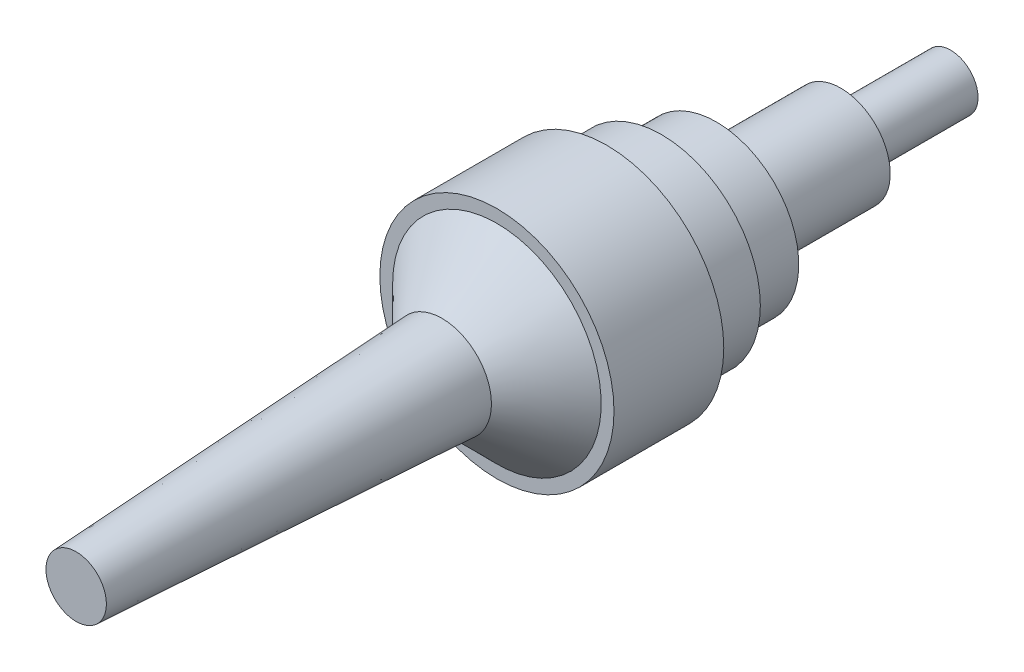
ISO-10303-21;
HEADER;
FILE_DESCRIPTION(('STEP AP214'),'2;1');
FILE_NAME('part.step','',(''),(''),'','','');
FILE_SCHEMA(('AUTOMOTIVE_DESIGN { 1 0 10303 214 1 1 1 1 }'));
ENDSEC;
DATA;
#1=APPLICATION_CONTEXT('core data for automotive mechanical design processes');
#2=APPLICATION_PROTOCOL_DEFINITION('international standard','automotive_design',2000,#1);
#3=PRODUCT_CONTEXT('',#1,'mechanical');
#4=PRODUCT('Part','Part','',(#3));
#5=PRODUCT_RELATED_PRODUCT_CATEGORY('part','',(#4));
#6=PRODUCT_DEFINITION_FORMATION('','',#4);
#7=PRODUCT_DEFINITION_CONTEXT('part definition',#1,'design');
#8=PRODUCT_DEFINITION('design','',#6,#7);
#9=PRODUCT_DEFINITION_SHAPE('','',#8);
#10=(LENGTH_UNIT() NAMED_UNIT(*) SI_UNIT(.MILLI.,.METRE.));
#11=(NAMED_UNIT(*) PLANE_ANGLE_UNIT() SI_UNIT($,.RADIAN.));
#12=(NAMED_UNIT(*) SI_UNIT($,.STERADIAN.) SOLID_ANGLE_UNIT());
#13=UNCERTAINTY_MEASURE_WITH_UNIT(LENGTH_MEASURE(1.E-05),#10,'distance_accuracy_value','');
#14=(GEOMETRIC_REPRESENTATION_CONTEXT(3) GLOBAL_UNCERTAINTY_ASSIGNED_CONTEXT((#13)) GLOBAL_UNIT_ASSIGNED_CONTEXT((#10,
#11,#12)) REPRESENTATION_CONTEXT('',''));
#15=CARTESIAN_POINT('',(0.,0.,0.));
#16=DIRECTION('',(0.,0.,1.));
#17=DIRECTION('',(1.,0.,0.));
#18=AXIS2_PLACEMENT_3D('',#15,#16,#17);
#19=CARTESIAN_POINT('',(0.,0.,0.));
#20=DIRECTION('',(0.,0.,-1.));
#21=DIRECTION('',(1.,0.,0.));
#22=AXIS2_PLACEMENT_3D('',#19,#20,#21);
#23=CONICAL_SURFACE('',#22,1.35,0.05235987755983);
#24=CARTESIAN_POINT('',(0.,0.,10.));
#25=DIRECTION('',(0.,0.,1.));
#26=DIRECTION('',(1.,0.,0.));
#27=AXIS2_PLACEMENT_3D('',#24,#25,#26);
#28=CIRCLE('',#27,0.825922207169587);
#29=CARTESIAN_POINT('',(0.825922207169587,0.,10.));
#30=VERTEX_POINT('',#29);
#31=EDGE_CURVE('E46',#30,#30,#28,.T.);
#32=ORIENTED_EDGE('',*,*,#31,.F.);
#33=EDGE_LOOP('',(#32));
#34=FACE_BOUND('',#33,.T.);
#35=CARTESIAN_POINT('',(0.,0.,0.));
#36=DIRECTION('',(0.,0.,-1.));
#37=DIRECTION('',(-1.,0.,0.));
#38=AXIS2_PLACEMENT_3D('',#35,#36,#37);
#39=CIRCLE('',#38,1.35);
#40=CARTESIAN_POINT('',(-1.35,0.,0.));
#41=VERTEX_POINT('',#40);
#42=EDGE_CURVE('E86',#41,#41,#39,.T.);
#43=ORIENTED_EDGE('',*,*,#42,.F.);
#44=EDGE_LOOP('',(#43));
#45=FACE_BOUND('',#44,.T.);
#46=ADVANCED_FACE('F43',(#34,#45),#23,.T.);
#47=CARTESIAN_POINT('',(0.,0.,10.));
#48=DIRECTION('',(0.,0.,1.));
#49=DIRECTION('',(1.,0.,0.));
#50=AXIS2_PLACEMENT_3D('',#47,#48,#49);
#51=PLANE('',#50);
#52=ORIENTED_EDGE('',*,*,#31,.T.);
#53=EDGE_LOOP('',(#52));
#54=FACE_BOUND('',#53,.T.);
#55=ADVANCED_FACE('F101',(#54),#51,.T.);
#56=CARTESIAN_POINT('',(0.,0.,0.));
#57=DIRECTION('',(0.,0.,-1.));
#58=DIRECTION('',(-1.,0.,0.));
#59=AXIS2_PLACEMENT_3D('',#56,#57,#58);
#60=CONICAL_SURFACE('',#59,1.35,0.78539816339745);
#61=CARTESIAN_POINT('',(0.,0.,-1.5));
#62=DIRECTION('',(0.,0.,-1.));
#63=DIRECTION('',(-1.,0.,0.));
#64=AXIS2_PLACEMENT_3D('',#61,#62,#63);
#65=CIRCLE('',#64,2.85000000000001);
#66=CARTESIAN_POINT('',(-2.85000000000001,0.,-1.5));
#67=VERTEX_POINT('',#66);
#68=EDGE_CURVE('E92',#67,#67,#65,.T.);
#69=ORIENTED_EDGE('',*,*,#68,.F.);
#70=EDGE_LOOP('',(#69));
#71=FACE_BOUND('',#70,.T.);
#72=ORIENTED_EDGE('',*,*,#42,.T.);
#73=EDGE_LOOP('',(#72));
#74=FACE_BOUND('',#73,.T.);
#75=ADVANCED_FACE('F107',(#71,#74),#60,.T.);
#76=CARTESIAN_POINT('',(0.,0.,-4.5));
#77=DIRECTION('',(0.,0.,1.));
#78=DIRECTION('',(1.,0.,0.));
#79=AXIS2_PLACEMENT_3D('',#76,#77,#78);
#80=CYLINDRICAL_SURFACE('',#79,3.2);
#81=CARTESIAN_POINT('',(0.,0.,-4.5));
#82=DIRECTION('',(0.,0.,-1.));
#83=DIRECTION('',(-1.,0.,0.));
#84=AXIS2_PLACEMENT_3D('',#81,#82,#83);
#85=CIRCLE('',#84,3.2);
#86=CARTESIAN_POINT('',(-3.2,0.,-4.5));
#87=VERTEX_POINT('',#86);
#88=EDGE_CURVE('E82',#87,#87,#85,.T.);
#89=ORIENTED_EDGE('',*,*,#88,.F.);
#90=EDGE_LOOP('',(#89));
#91=FACE_BOUND('',#90,.T.);
#92=CARTESIAN_POINT('',(0.,0.,-1.5));
#93=DIRECTION('',(0.,0.,-1.));
#94=DIRECTION('',(-1.,0.,0.));
#95=AXIS2_PLACEMENT_3D('',#92,#93,#94);
#96=CIRCLE('',#95,3.2);
#97=CARTESIAN_POINT('',(-3.2,0.,-1.5));
#98=VERTEX_POINT('',#97);
#99=EDGE_CURVE('E78',#98,#98,#96,.T.);
#100=ORIENTED_EDGE('',*,*,#99,.T.);
#101=EDGE_LOOP('',(#100));
#102=FACE_BOUND('',#101,.T.);
#103=ADVANCED_FACE('F109',(#91,#102),#80,.T.);
#104=CARTESIAN_POINT('',(0.,0.,-4.5));
#105=DIRECTION('',(0.,0.,-1.));
#106=DIRECTION('',(-1.,0.,0.));
#107=AXIS2_PLACEMENT_3D('',#104,#105,#106);
#108=PLANE('',#107);
#109=CARTESIAN_POINT('',(0.,0.,-4.5));
#110=DIRECTION('',(0.,0.,-1.));
#111=DIRECTION('',(-1.,0.,0.));
#112=AXIS2_PLACEMENT_3D('',#109,#110,#111);
#113=CIRCLE('',#112,2.7);
#114=CARTESIAN_POINT('',(-2.7,0.,-4.5));
#115=VERTEX_POINT('',#114);
#116=EDGE_CURVE('E74',#115,#115,#113,.T.);
#117=ORIENTED_EDGE('',*,*,#116,.F.);
#118=EDGE_LOOP('',(#117));
#119=FACE_BOUND('',#118,.T.);
#120=ORIENTED_EDGE('',*,*,#88,.T.);
#121=EDGE_LOOP('',(#120));
#122=FACE_BOUND('',#121,.T.);
#123=ADVANCED_FACE('F116',(#119,#122),#108,.T.);
#124=CARTESIAN_POINT('',(0.,0.,-1.5));
#125=DIRECTION('',(0.,0.,-1.));
#126=DIRECTION('',(-1.,0.,0.));
#127=AXIS2_PLACEMENT_3D('',#124,#125,#126);
#128=PLANE('',#127);
#129=ORIENTED_EDGE('',*,*,#68,.T.);
#130=EDGE_LOOP('',(#129));
#131=FACE_BOUND('',#130,.T.);
#132=ORIENTED_EDGE('',*,*,#99,.F.);
#133=EDGE_LOOP('',(#132));
#134=FACE_BOUND('',#133,.T.);
#135=ADVANCED_FACE('F120',(#131,#134),#128,.F.);
#136=CARTESIAN_POINT('',(0.,0.,-6.));
#137=DIRECTION('',(0.,0.,1.));
#138=DIRECTION('',(1.,0.,0.));
#139=AXIS2_PLACEMENT_3D('',#136,#137,#138);
#140=CYLINDRICAL_SURFACE('',#139,2.7);
#141=CARTESIAN_POINT('',(0.,0.,-6.));
#142=DIRECTION('',(0.,0.,-1.));
#143=DIRECTION('',(-1.,0.,0.));
#144=AXIS2_PLACEMENT_3D('',#141,#142,#143);
#145=CIRCLE('',#144,2.7);
#146=CARTESIAN_POINT('',(-2.7,0.,-6.));
#147=VERTEX_POINT('',#146);
#148=EDGE_CURVE('E70',#147,#147,#145,.T.);
#149=ORIENTED_EDGE('',*,*,#148,.F.);
#150=EDGE_LOOP('',(#149));
#151=FACE_BOUND('',#150,.T.);
#152=ORIENTED_EDGE('',*,*,#116,.T.);
#153=EDGE_LOOP('',(#152));
#154=FACE_BOUND('',#153,.T.);
#155=ADVANCED_FACE('F123',(#151,#154),#140,.T.);
#156=CARTESIAN_POINT('',(0.,0.,-6.));
#157=DIRECTION('',(0.,0.,-1.));
#158=DIRECTION('',(-1.,0.,0.));
#159=AXIS2_PLACEMENT_3D('',#156,#157,#158);
#160=PLANE('',#159);
#161=CARTESIAN_POINT('',(0.,0.,-6.));
#162=DIRECTION('',(0.,0.,-1.));
#163=DIRECTION('',(-1.,0.,0.));
#164=AXIS2_PLACEMENT_3D('',#161,#162,#163);
#165=CIRCLE('',#164,2.25);
#166=CARTESIAN_POINT('',(-2.25,0.,-6.));
#167=VERTEX_POINT('',#166);
#168=EDGE_CURVE('E57',#167,#167,#165,.T.);
#169=ORIENTED_EDGE('',*,*,#168,.F.);
#170=EDGE_LOOP('',(#169));
#171=FACE_BOUND('',#170,.T.);
#172=ORIENTED_EDGE('',*,*,#148,.T.);
#173=EDGE_LOOP('',(#172));
#174=FACE_BOUND('',#173,.T.);
#175=ADVANCED_FACE('F129',(#171,#174),#160,.T.);
#176=CARTESIAN_POINT('',(0.,0.,-7.5));
#177=DIRECTION('',(0.,0.,1.));
#178=DIRECTION('',(1.,0.,0.));
#179=AXIS2_PLACEMENT_3D('',#176,#177,#178);
#180=CYLINDRICAL_SURFACE('',#179,2.25);
#181=CARTESIAN_POINT('',(0.,0.,-7.5));
#182=DIRECTION('',(0.,0.,-1.));
#183=DIRECTION('',(-1.,0.,0.));
#184=AXIS2_PLACEMENT_3D('',#181,#182,#183);
#185=CIRCLE('',#184,2.25);
#186=CARTESIAN_POINT('',(-2.25,0.,-7.5));
#187=VERTEX_POINT('',#186);
#188=EDGE_CURVE('E65',#187,#187,#185,.T.);
#189=ORIENTED_EDGE('',*,*,#188,.F.);
#190=EDGE_LOOP('',(#189));
#191=FACE_BOUND('',#190,.T.);
#192=ORIENTED_EDGE('',*,*,#168,.T.);
#193=EDGE_LOOP('',(#192));
#194=FACE_BOUND('',#193,.T.);
#195=ADVANCED_FACE('F133',(#191,#194),#180,.T.);
#196=CARTESIAN_POINT('',(0.,0.,-7.5));
#197=DIRECTION('',(0.,0.,-1.));
#198=DIRECTION('',(-1.,0.,0.));
#199=AXIS2_PLACEMENT_3D('',#196,#197,#198);
#200=PLANE('',#199);
#201=CARTESIAN_POINT('',(0.,0.,-7.5));
#202=DIRECTION('',(0.,0.,-1.));
#203=DIRECTION('',(-1.,0.,0.));
#204=AXIS2_PLACEMENT_3D('',#201,#202,#203);
#205=CIRCLE('',#204,1.35);
#206=CARTESIAN_POINT('',(-1.35,0.,-7.5));
#207=VERTEX_POINT('',#206);
#208=EDGE_CURVE('E51',#207,#207,#205,.T.);
#209=ORIENTED_EDGE('',*,*,#208,.F.);
#210=EDGE_LOOP('',(#209));
#211=FACE_BOUND('',#210,.T.);
#212=ORIENTED_EDGE('',*,*,#188,.T.);
#213=EDGE_LOOP('',(#212));
#214=FACE_BOUND('',#213,.T.);
#215=ADVANCED_FACE('F137',(#211,#214),#200,.T.);
#216=CARTESIAN_POINT('',(0.,0.,-10.9));
#217=DIRECTION('',(0.,0.,1.));
#218=DIRECTION('',(1.,0.,0.));
#219=AXIS2_PLACEMENT_3D('',#216,#217,#218);
#220=CYLINDRICAL_SURFACE('',#219,1.35);
#221=CARTESIAN_POINT('',(0.,0.,-10.9));
#222=DIRECTION('',(0.,0.,-1.));
#223=DIRECTION('',(-1.,0.,0.));
#224=AXIS2_PLACEMENT_3D('',#221,#222,#223);
#225=CIRCLE('',#224,1.35);
#226=CARTESIAN_POINT('',(-1.35,0.,-10.9));
#227=VERTEX_POINT('',#226);
#228=EDGE_CURVE('E62',#227,#227,#225,.T.);
#229=ORIENTED_EDGE('',*,*,#228,.F.);
#230=EDGE_LOOP('',(#229));
#231=FACE_BOUND('',#230,.T.);
#232=ORIENTED_EDGE('',*,*,#208,.T.);
#233=EDGE_LOOP('',(#232));
#234=FACE_BOUND('',#233,.T.);
#235=ADVANCED_FACE('F141',(#231,#234),#220,.T.);
#236=CARTESIAN_POINT('',(0.,0.,-10.9));
#237=DIRECTION('',(0.,0.,-1.));
#238=DIRECTION('',(-1.,0.,0.));
#239=AXIS2_PLACEMENT_3D('',#236,#237,#238);
#240=PLANE('',#239);
#241=CARTESIAN_POINT('',(0.,0.,-10.9));
#242=DIRECTION('',(0.,0.,-1.));
#243=DIRECTION('',(-1.,0.,0.));
#244=AXIS2_PLACEMENT_3D('',#241,#242,#243);
#245=CIRCLE('',#244,0.75);
#246=CARTESIAN_POINT('',(-0.75,0.,-10.9));
#247=VERTEX_POINT('',#246);
#248=EDGE_CURVE('E10',#247,#247,#245,.T.);
#249=ORIENTED_EDGE('',*,*,#248,.F.);
#250=EDGE_LOOP('',(#249));
#251=FACE_BOUND('',#250,.T.);
#252=ORIENTED_EDGE('',*,*,#228,.T.);
#253=EDGE_LOOP('',(#252));
#254=FACE_BOUND('',#253,.T.);
#255=ADVANCED_FACE('F145',(#251,#254),#240,.T.);
#256=CARTESIAN_POINT('',(0.,0.,-13.9));
#257=DIRECTION('',(0.,0.,1.));
#258=DIRECTION('',(1.,0.,0.));
#259=AXIS2_PLACEMENT_3D('',#256,#257,#258);
#260=CYLINDRICAL_SURFACE('',#259,0.75);
#261=CARTESIAN_POINT('',(0.,0.,-13.9));
#262=DIRECTION('',(0.,0.,-1.));
#263=DIRECTION('',(-1.,0.,0.));
#264=AXIS2_PLACEMENT_3D('',#261,#262,#263);
#265=CIRCLE('',#264,0.75);
#266=CARTESIAN_POINT('',(-0.75,0.,-13.9));
#267=VERTEX_POINT('',#266);
#268=EDGE_CURVE('E61',#267,#267,#265,.T.);
#269=ORIENTED_EDGE('',*,*,#268,.F.);
#270=EDGE_LOOP('',(#269));
#271=FACE_BOUND('',#270,.T.);
#272=ORIENTED_EDGE('',*,*,#248,.T.);
#273=EDGE_LOOP('',(#272));
#274=FACE_BOUND('',#273,.T.);
#275=ADVANCED_FACE('F149',(#271,#274),#260,.T.);
#276=CARTESIAN_POINT('',(0.,0.,-13.9));
#277=DIRECTION('',(0.,0.,-1.));
#278=DIRECTION('',(-1.,0.,0.));
#279=AXIS2_PLACEMENT_3D('',#276,#277,#278);
#280=PLANE('',#279);
#281=ORIENTED_EDGE('',*,*,#268,.T.);
#282=EDGE_LOOP('',(#281));
#283=FACE_BOUND('',#282,.T.);
#284=ADVANCED_FACE('F153',(#283),#280,.T.);
#285=CLOSED_SHELL('',(#46,#55,#75,#103,#123,#135,#155,#175,#195,#215,#235,#255,#275,#284));
#286=MANIFOLD_SOLID_BREP('B2',#285);
#287=ADVANCED_BREP_SHAPE_REPRESENTATION('',(#18,#286),#14);
#288=SHAPE_DEFINITION_REPRESENTATION(#9,#287);
ENDSEC;
END-ISO-10303-21;
